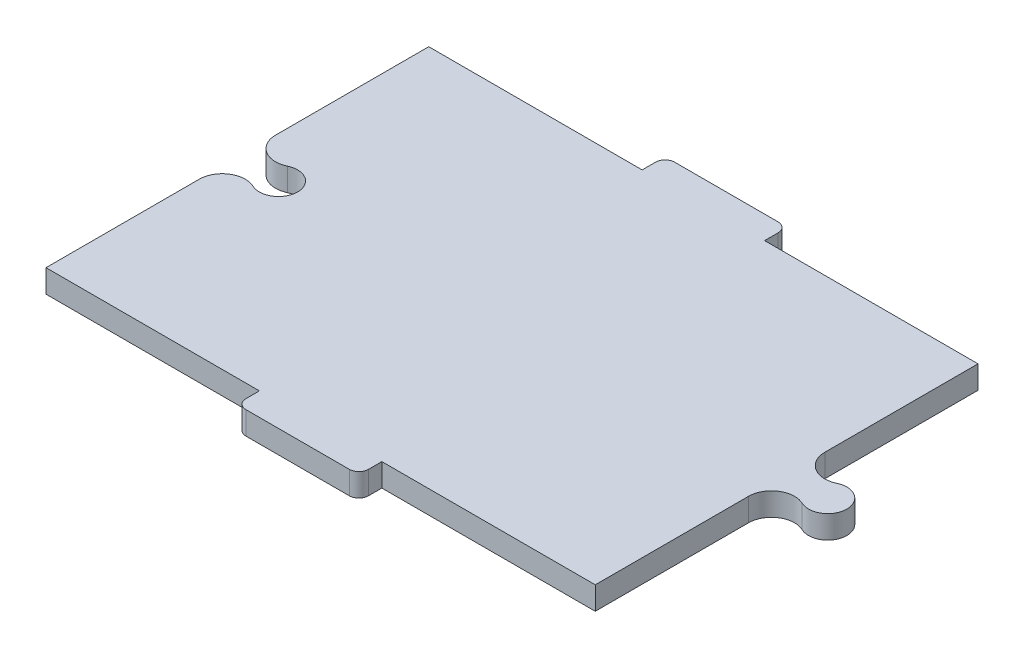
ISO-10303-21;
HEADER;
FILE_DESCRIPTION(('STEP AP214'),'2;1');
FILE_NAME('part.step','',(''),(''),'','','');
FILE_SCHEMA(('AUTOMOTIVE_DESIGN { 1 0 10303 214 1 1 1 1 }'));
ENDSEC;
DATA;
#1=APPLICATION_CONTEXT('core data for automotive mechanical design processes');
#2=APPLICATION_PROTOCOL_DEFINITION('international standard','automotive_design',2000,#1);
#3=PRODUCT_CONTEXT('',#1,'mechanical');
#4=PRODUCT('Part','Part','',(#3));
#5=PRODUCT_RELATED_PRODUCT_CATEGORY('part','',(#4));
#6=PRODUCT_DEFINITION_FORMATION('','',#4);
#7=PRODUCT_DEFINITION_CONTEXT('part definition',#1,'design');
#8=PRODUCT_DEFINITION('design','',#6,#7);
#9=PRODUCT_DEFINITION_SHAPE('','',#8);
#10=(LENGTH_UNIT() NAMED_UNIT(*) SI_UNIT(.MILLI.,.METRE.));
#11=(NAMED_UNIT(*) PLANE_ANGLE_UNIT() SI_UNIT($,.RADIAN.));
#12=(NAMED_UNIT(*) SI_UNIT($,.STERADIAN.) SOLID_ANGLE_UNIT());
#13=UNCERTAINTY_MEASURE_WITH_UNIT(LENGTH_MEASURE(1.E-05),#10,'distance_accuracy_value','');
#14=(GEOMETRIC_REPRESENTATION_CONTEXT(3) GLOBAL_UNCERTAINTY_ASSIGNED_CONTEXT((#13)) GLOBAL_UNIT_ASSIGNED_CONTEXT((#10,
#11,#12)) REPRESENTATION_CONTEXT('',''));
#15=CARTESIAN_POINT('',(0.,0.,0.));
#16=DIRECTION('',(0.,0.,1.));
#17=DIRECTION('',(1.,0.,0.));
#18=AXIS2_PLACEMENT_3D('',#15,#16,#17);
#19=CARTESIAN_POINT('',(143.505,12.,-19.9333928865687));
#20=DIRECTION('',(-1.,0.,0.));
#21=DIRECTION('',(0.,0.,1.));
#22=AXIS2_PLACEMENT_3D('',#19,#20,#21);
#23=PLANE('',#22);
#24=DIRECTION('',(0.,0.,-1.));
#25=VECTOR('',#24,1.);
#26=CARTESIAN_POINT('',(143.505,0.,-19.9333928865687));
#27=LINE('',#26,#25);
#28=CARTESIAN_POINT('',(143.505,0.,-19.9333928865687));
#29=VERTEX_POINT('',#28);
#30=CARTESIAN_POINT('',(143.505,0.,-100.));
#31=VERTEX_POINT('',#30);
#32=EDGE_CURVE('E224',#29,#31,#27,.T.);
#33=ORIENTED_EDGE('',*,*,#32,.T.);
#34=DIRECTION('',(0.,-1.,0.));
#35=VECTOR('',#34,1.);
#36=CARTESIAN_POINT('',(143.505,12.,-100.));
#37=LINE('',#36,#35);
#38=CARTESIAN_POINT('',(143.505,12.,-100.));
#39=VERTEX_POINT('',#38);
#40=EDGE_CURVE('E11',#39,#31,#37,.T.);
#41=ORIENTED_EDGE('',*,*,#40,.F.);
#42=DIRECTION('',(0.,0.,-1.));
#43=VECTOR('',#42,1.);
#44=CARTESIAN_POINT('',(143.505,12.,-19.9333928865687));
#45=LINE('',#44,#43);
#46=CARTESIAN_POINT('',(143.505,12.,-19.9333928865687));
#47=VERTEX_POINT('',#46);
#48=EDGE_CURVE('E270',#47,#39,#45,.T.);
#49=ORIENTED_EDGE('',*,*,#48,.F.);
#50=DIRECTION('',(0.,-1.,0.));
#51=VECTOR('',#50,1.);
#52=CARTESIAN_POINT('',(143.505,12.,-19.9333928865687));
#53=LINE('',#52,#51);
#54=EDGE_CURVE('E220',#47,#29,#53,.T.);
#55=ORIENTED_EDGE('',*,*,#54,.T.);
#56=EDGE_LOOP('',(#33,#41,#49,#55));
#57=FACE_BOUND('',#56,.T.);
#58=ADVANCED_FACE('F32',(#57),#23,.F.);
#59=CARTESIAN_POINT('',(32.,12.,-100.));
#60=DIRECTION('',(0.,0.,1.));
#61=DIRECTION('',(1.,0.,0.));
#62=AXIS2_PLACEMENT_3D('',#59,#60,#61);
#63=PLANE('',#62);
#64=DIRECTION('',(-1.,0.,0.));
#65=VECTOR('',#64,1.);
#66=CARTESIAN_POINT('',(32.,0.,-100.));
#67=LINE('',#66,#65);
#68=CARTESIAN_POINT('',(32.,0.,-100.));
#69=VERTEX_POINT('',#68);
#70=EDGE_CURVE('E227',#31,#69,#67,.T.);
#71=ORIENTED_EDGE('',*,*,#70,.T.);
#72=DIRECTION('',(0.,-1.,0.));
#73=VECTOR('',#72,1.);
#74=CARTESIAN_POINT('',(32.,12.,-100.));
#75=LINE('',#74,#73);
#76=CARTESIAN_POINT('',(32.,12.,-100.));
#77=VERTEX_POINT('',#76);
#78=EDGE_CURVE('E40',#77,#69,#75,.T.);
#79=ORIENTED_EDGE('',*,*,#78,.F.);
#80=DIRECTION('',(-1.,0.,0.));
#81=VECTOR('',#80,1.);
#82=CARTESIAN_POINT('',(32.,12.,-100.));
#83=LINE('',#82,#81);
#84=EDGE_CURVE('E139',#39,#77,#83,.T.);
#85=ORIENTED_EDGE('',*,*,#84,.F.);
#86=ORIENTED_EDGE('',*,*,#40,.T.);
#87=EDGE_LOOP('',(#71,#79,#85,#86));
#88=FACE_BOUND('',#87,.T.);
#89=ADVANCED_FACE('F408',(#88),#63,.F.);
#90=CARTESIAN_POINT('',(32.,12.,-107.));
#91=DIRECTION('',(-1.,0.,0.));
#92=DIRECTION('',(0.,0.,1.));
#93=AXIS2_PLACEMENT_3D('',#90,#91,#92);
#94=PLANE('',#93);
#95=DIRECTION('',(0.,0.,-1.));
#96=VECTOR('',#95,1.);
#97=CARTESIAN_POINT('',(32.,0.,-107.));
#98=LINE('',#97,#96);
#99=CARTESIAN_POINT('',(32.,0.,-107.));
#100=VERTEX_POINT('',#99);
#101=EDGE_CURVE('E229',#69,#100,#98,.T.);
#102=ORIENTED_EDGE('',*,*,#101,.T.);
#103=DIRECTION('',(0.,-1.,0.));
#104=VECTOR('',#103,1.);
#105=CARTESIAN_POINT('',(32.,12.,-107.));
#106=LINE('',#105,#104);
#107=CARTESIAN_POINT('',(32.,12.,-107.));
#108=VERTEX_POINT('',#107);
#109=EDGE_CURVE('E325',#108,#100,#106,.T.);
#110=ORIENTED_EDGE('',*,*,#109,.F.);
#111=DIRECTION('',(0.,0.,-1.));
#112=VECTOR('',#111,1.);
#113=CARTESIAN_POINT('',(32.,12.,-107.));
#114=LINE('',#113,#112);
#115=EDGE_CURVE('E333',#77,#108,#114,.T.);
#116=ORIENTED_EDGE('',*,*,#115,.F.);
#117=ORIENTED_EDGE('',*,*,#78,.T.);
#118=EDGE_LOOP('',(#102,#110,#116,#117));
#119=FACE_BOUND('',#118,.T.);
#120=ADVANCED_FACE('F331',(#119),#94,.F.);
#121=CARTESIAN_POINT('',(27.,12.,-107.));
#122=DIRECTION('',(0.,-1.,0.));
#123=DIRECTION('',(0.,0.,-1.));
#124=AXIS2_PLACEMENT_3D('',#121,#122,#123);
#125=CYLINDRICAL_SURFACE('',#124,5.00000000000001);
#126=CARTESIAN_POINT('',(27.,0.,-107.));
#127=DIRECTION('',(0.,1.,0.));
#128=DIRECTION('',(0.,0.,-1.));
#129=AXIS2_PLACEMENT_3D('',#126,#127,#128);
#130=CIRCLE('',#129,5.00000000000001);
#131=CARTESIAN_POINT('',(27.,0.,-112.));
#132=VERTEX_POINT('',#131);
#133=EDGE_CURVE('E231',#100,#132,#130,.T.);
#134=ORIENTED_EDGE('',*,*,#133,.T.);
#135=DIRECTION('',(0.,-1.,0.));
#136=VECTOR('',#135,1.);
#137=CARTESIAN_POINT('',(27.,12.,-112.));
#138=LINE('',#137,#136);
#139=CARTESIAN_POINT('',(27.,12.,-112.));
#140=VERTEX_POINT('',#139);
#141=EDGE_CURVE('E322',#140,#132,#138,.T.);
#142=ORIENTED_EDGE('',*,*,#141,.F.);
#143=CARTESIAN_POINT('',(27.,12.,-107.));
#144=DIRECTION('',(0.,1.,0.));
#145=DIRECTION('',(0.,0.,-1.));
#146=AXIS2_PLACEMENT_3D('',#143,#144,#145);
#147=CIRCLE('',#146,5.00000000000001);
#148=EDGE_CURVE('E351',#108,#140,#147,.T.);
#149=ORIENTED_EDGE('',*,*,#148,.F.);
#150=ORIENTED_EDGE('',*,*,#109,.T.);
#151=EDGE_LOOP('',(#134,#142,#149,#150));
#152=FACE_BOUND('',#151,.T.);
#153=ADVANCED_FACE('F342',(#152),#125,.T.);
#154=CARTESIAN_POINT('',(-27.,12.,-112.));
#155=DIRECTION('',(0.,0.,1.));
#156=DIRECTION('',(1.,0.,0.));
#157=AXIS2_PLACEMENT_3D('',#154,#155,#156);
#158=PLANE('',#157);
#159=DIRECTION('',(-1.,0.,0.));
#160=VECTOR('',#159,1.);
#161=CARTESIAN_POINT('',(-27.,0.,-112.));
#162=LINE('',#161,#160);
#163=CARTESIAN_POINT('',(-27.,0.,-112.));
#164=VERTEX_POINT('',#163);
#165=EDGE_CURVE('E233',#132,#164,#162,.T.);
#166=ORIENTED_EDGE('',*,*,#165,.T.);
#167=DIRECTION('',(0.,-1.,0.));
#168=VECTOR('',#167,1.);
#169=CARTESIAN_POINT('',(-27.,12.,-112.));
#170=LINE('',#169,#168);
#171=CARTESIAN_POINT('',(-27.,12.,-112.));
#172=VERTEX_POINT('',#171);
#173=EDGE_CURVE('E319',#172,#164,#170,.T.);
#174=ORIENTED_EDGE('',*,*,#173,.F.);
#175=DIRECTION('',(-1.,0.,0.));
#176=VECTOR('',#175,1.);
#177=CARTESIAN_POINT('',(-27.,12.,-112.));
#178=LINE('',#177,#176);
#179=EDGE_CURVE('E348',#140,#172,#178,.T.);
#180=ORIENTED_EDGE('',*,*,#179,.F.);
#181=ORIENTED_EDGE('',*,*,#141,.T.);
#182=EDGE_LOOP('',(#166,#174,#180,#181));
#183=FACE_BOUND('',#182,.T.);
#184=ADVANCED_FACE('F346',(#183),#158,.F.);
#185=CARTESIAN_POINT('',(-27.,12.,-107.));
#186=DIRECTION('',(0.,-1.,0.));
#187=DIRECTION('',(0.,0.,-1.));
#188=AXIS2_PLACEMENT_3D('',#185,#186,#187);
#189=CYLINDRICAL_SURFACE('',#188,5.);
#190=CARTESIAN_POINT('',(-27.,0.,-107.));
#191=DIRECTION('',(0.,1.,0.));
#192=DIRECTION('',(0.,0.,-1.));
#193=AXIS2_PLACEMENT_3D('',#190,#191,#192);
#194=CIRCLE('',#193,5.);
#195=CARTESIAN_POINT('',(-32.,0.,-107.));
#196=VERTEX_POINT('',#195);
#197=EDGE_CURVE('E235',#164,#196,#194,.T.);
#198=ORIENTED_EDGE('',*,*,#197,.T.);
#199=DIRECTION('',(0.,-1.,0.));
#200=VECTOR('',#199,1.);
#201=CARTESIAN_POINT('',(-32.,12.,-107.));
#202=LINE('',#201,#200);
#203=CARTESIAN_POINT('',(-32.,12.,-107.));
#204=VERTEX_POINT('',#203);
#205=EDGE_CURVE('E316',#204,#196,#202,.T.);
#206=ORIENTED_EDGE('',*,*,#205,.F.);
#207=CARTESIAN_POINT('',(-27.,12.,-107.));
#208=DIRECTION('',(0.,1.,0.));
#209=DIRECTION('',(0.,0.,-1.));
#210=AXIS2_PLACEMENT_3D('',#207,#208,#209);
#211=CIRCLE('',#210,5.);
#212=EDGE_CURVE('E350',#172,#204,#211,.T.);
#213=ORIENTED_EDGE('',*,*,#212,.F.);
#214=ORIENTED_EDGE('',*,*,#173,.T.);
#215=EDGE_LOOP('',(#198,#206,#213,#214));
#216=FACE_BOUND('',#215,.T.);
#217=ADVANCED_FACE('F421',(#216),#189,.T.);
#218=CARTESIAN_POINT('',(-32.,12.,-100.));
#219=DIRECTION('',(1.,0.,0.));
#220=DIRECTION('',(0.,0.,-1.));
#221=AXIS2_PLACEMENT_3D('',#218,#219,#220);
#222=PLANE('',#221);
#223=DIRECTION('',(0.,0.,1.));
#224=VECTOR('',#223,1.);
#225=CARTESIAN_POINT('',(-32.,0.,-100.));
#226=LINE('',#225,#224);
#227=CARTESIAN_POINT('',(-32.,0.,-100.));
#228=VERTEX_POINT('',#227);
#229=EDGE_CURVE('E237',#196,#228,#226,.T.);
#230=ORIENTED_EDGE('',*,*,#229,.T.);
#231=DIRECTION('',(0.,-1.,0.));
#232=VECTOR('',#231,1.);
#233=CARTESIAN_POINT('',(-32.,12.,-100.));
#234=LINE('',#233,#232);
#235=CARTESIAN_POINT('',(-32.,12.,-100.));
#236=VERTEX_POINT('',#235);
#237=EDGE_CURVE('E313',#236,#228,#234,.T.);
#238=ORIENTED_EDGE('',*,*,#237,.F.);
#239=DIRECTION('',(0.,0.,1.));
#240=VECTOR('',#239,1.);
#241=CARTESIAN_POINT('',(-32.,12.,-100.));
#242=LINE('',#241,#240);
#243=EDGE_CURVE('E353',#204,#236,#242,.T.);
#244=ORIENTED_EDGE('',*,*,#243,.F.);
#245=ORIENTED_EDGE('',*,*,#205,.T.);
#246=EDGE_LOOP('',(#230,#238,#244,#245));
#247=FACE_BOUND('',#246,.T.);
#248=ADVANCED_FACE('F424',(#247),#222,.F.);
#249=CARTESIAN_POINT('',(-143.505,12.,-100.));
#250=DIRECTION('',(0.,0.,1.));
#251=DIRECTION('',(1.,0.,0.));
#252=AXIS2_PLACEMENT_3D('',#249,#250,#251);
#253=PLANE('',#252);
#254=DIRECTION('',(-1.,0.,0.));
#255=VECTOR('',#254,1.);
#256=CARTESIAN_POINT('',(-143.505,0.,-100.));
#257=LINE('',#256,#255);
#258=CARTESIAN_POINT('',(-143.505,0.,-100.));
#259=VERTEX_POINT('',#258);
#260=EDGE_CURVE('E239',#228,#259,#257,.T.);
#261=ORIENTED_EDGE('',*,*,#260,.T.);
#262=DIRECTION('',(0.,-1.,0.));
#263=VECTOR('',#262,1.);
#264=CARTESIAN_POINT('',(-143.505,12.,-100.));
#265=LINE('',#264,#263);
#266=CARTESIAN_POINT('',(-143.505,12.,-100.));
#267=VERTEX_POINT('',#266);
#268=EDGE_CURVE('E310',#267,#259,#265,.T.);
#269=ORIENTED_EDGE('',*,*,#268,.F.);
#270=DIRECTION('',(-1.,0.,0.));
#271=VECTOR('',#270,1.);
#272=CARTESIAN_POINT('',(-143.505,12.,-100.));
#273=LINE('',#272,#271);
#274=EDGE_CURVE('E359',#236,#267,#273,.T.);
#275=ORIENTED_EDGE('',*,*,#274,.F.);
#276=ORIENTED_EDGE('',*,*,#237,.T.);
#277=EDGE_LOOP('',(#261,#269,#275,#276));
#278=FACE_BOUND('',#277,.T.);
#279=ADVANCED_FACE('F428',(#278),#253,.F.);
#280=CARTESIAN_POINT('',(-143.505,12.,-19.935));
#281=DIRECTION('',(1.,0.,0.));
#282=DIRECTION('',(0.,0.,-1.));
#283=AXIS2_PLACEMENT_3D('',#280,#281,#282);
#284=PLANE('',#283);
#285=DIRECTION('',(0.,0.,1.));
#286=VECTOR('',#285,1.);
#287=CARTESIAN_POINT('',(-143.505,0.,-19.935));
#288=LINE('',#287,#286);
#289=CARTESIAN_POINT('',(-143.505,0.,-19.935));
#290=VERTEX_POINT('',#289);
#291=EDGE_CURVE('E241',#259,#290,#288,.T.);
#292=ORIENTED_EDGE('',*,*,#291,.T.);
#293=DIRECTION('',(0.,-1.,0.));
#294=VECTOR('',#293,1.);
#295=CARTESIAN_POINT('',(-143.505,12.,-19.935));
#296=LINE('',#295,#294);
#297=CARTESIAN_POINT('',(-143.505,12.,-19.935));
#298=VERTEX_POINT('',#297);
#299=EDGE_CURVE('E307',#298,#290,#296,.T.);
#300=ORIENTED_EDGE('',*,*,#299,.F.);
#301=DIRECTION('',(0.,0.,1.));
#302=VECTOR('',#301,1.);
#303=CARTESIAN_POINT('',(-143.505,12.,-19.935));
#304=LINE('',#303,#302);
#305=EDGE_CURVE('E361',#267,#298,#304,.T.);
#306=ORIENTED_EDGE('',*,*,#305,.F.);
#307=ORIENTED_EDGE('',*,*,#268,.T.);
#308=EDGE_LOOP('',(#292,#300,#306,#307));
#309=FACE_BOUND('',#308,.T.);
#310=ADVANCED_FACE('F432',(#309),#284,.F.);
#311=CARTESIAN_POINT('',(-131.455,12.,-19.935));
#312=DIRECTION('',(0.,-1.,0.));
#313=DIRECTION('',(0.,0.,-1.));
#314=AXIS2_PLACEMENT_3D('',#311,#312,#313);
#315=CYLINDRICAL_SURFACE('',#314,12.05);
#316=CARTESIAN_POINT('',(-131.455,0.,-19.935));
#317=DIRECTION('',(0.,1.,0.));
#318=DIRECTION('',(0.,0.,1.));
#319=AXIS2_PLACEMENT_3D('',#316,#317,#318);
#320=CIRCLE('',#319,12.05);
#321=CARTESIAN_POINT('',(-126.305314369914,0.,-9.04081632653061));
#322=VERTEX_POINT('',#321);
#323=EDGE_CURVE('E243',#290,#322,#320,.T.);
#324=ORIENTED_EDGE('',*,*,#323,.T.);
#325=DIRECTION('',(0.,-1.,0.));
#326=VECTOR('',#325,1.);
#327=CARTESIAN_POINT('',(-126.305314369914,12.,-9.04081632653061));
#328=LINE('',#327,#326);
#329=CARTESIAN_POINT('',(-126.305314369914,12.,-9.04081632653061));
#330=VERTEX_POINT('',#329);
#331=EDGE_CURVE('E304',#330,#322,#328,.T.);
#332=ORIENTED_EDGE('',*,*,#331,.F.);
#333=CARTESIAN_POINT('',(-131.455,12.,-19.935));
#334=DIRECTION('',(0.,1.,0.));
#335=DIRECTION('',(0.,0.,1.));
#336=AXIS2_PLACEMENT_3D('',#333,#334,#335);
#337=CIRCLE('',#336,12.05);
#338=EDGE_CURVE('E363',#298,#330,#337,.T.);
#339=ORIENTED_EDGE('',*,*,#338,.F.);
#340=ORIENTED_EDGE('',*,*,#299,.T.);
#341=EDGE_LOOP('',(#324,#332,#339,#340));
#342=FACE_BOUND('',#341,.T.);
#343=ADVANCED_FACE('F436',(#342),#315,.T.);
#344=CARTESIAN_POINT('',(-122.031716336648,12.,0.));
#345=DIRECTION('',(0.,-1.,0.));
#346=DIRECTION('',(0.,0.,-1.));
#347=AXIS2_PLACEMENT_3D('',#344,#345,#346);
#348=CYLINDRICAL_SURFACE('',#347,10.);
#349=CARTESIAN_POINT('',(-122.031716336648,0.,0.));
#350=DIRECTION('',(0.,-1.,0.));
#351=DIRECTION('',(0.,0.,-1.));
#352=AXIS2_PLACEMENT_3D('',#349,#350,#351);
#353=CIRCLE('',#352,10.);
#354=CARTESIAN_POINT('',(-126.305314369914,0.,9.04081632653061));
#355=VERTEX_POINT('',#354);
#356=EDGE_CURVE('E245',#322,#355,#353,.T.);
#357=ORIENTED_EDGE('',*,*,#356,.T.);
#358=DIRECTION('',(0.,-1.,0.));
#359=VECTOR('',#358,1.);
#360=CARTESIAN_POINT('',(-126.305314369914,12.,9.04081632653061));
#361=LINE('',#360,#359);
#362=CARTESIAN_POINT('',(-126.305314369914,12.,9.04081632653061));
#363=VERTEX_POINT('',#362);
#364=EDGE_CURVE('E301',#363,#355,#361,.T.);
#365=ORIENTED_EDGE('',*,*,#364,.F.);
#366=CARTESIAN_POINT('',(-122.031716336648,12.,0.));
#367=DIRECTION('',(0.,-1.,0.));
#368=DIRECTION('',(0.,0.,-1.));
#369=AXIS2_PLACEMENT_3D('',#366,#367,#368);
#370=CIRCLE('',#369,10.);
#371=EDGE_CURVE('E365',#330,#363,#370,.T.);
#372=ORIENTED_EDGE('',*,*,#371,.F.);
#373=ORIENTED_EDGE('',*,*,#331,.T.);
#374=EDGE_LOOP('',(#357,#365,#372,#373));
#375=FACE_BOUND('',#374,.T.);
#376=ADVANCED_FACE('F440',(#375),#348,.F.);
#377=CARTESIAN_POINT('',(-131.455,12.,19.935));
#378=DIRECTION('',(0.,-1.,0.));
#379=DIRECTION('',(0.,0.,-1.));
#380=AXIS2_PLACEMENT_3D('',#377,#378,#379);
#381=CYLINDRICAL_SURFACE('',#380,12.05);
#382=CARTESIAN_POINT('',(-131.455,0.,19.935));
#383=DIRECTION('',(0.,1.,0.));
#384=DIRECTION('',(0.,0.,-1.));
#385=AXIS2_PLACEMENT_3D('',#382,#383,#384);
#386=CIRCLE('',#385,12.05);
#387=CARTESIAN_POINT('',(-143.505,0.,19.935));
#388=VERTEX_POINT('',#387);
#389=EDGE_CURVE('E247',#355,#388,#386,.T.);
#390=ORIENTED_EDGE('',*,*,#389,.T.);
#391=DIRECTION('',(0.,-1.,0.));
#392=VECTOR('',#391,1.);
#393=CARTESIAN_POINT('',(-143.505,12.,19.935));
#394=LINE('',#393,#392);
#395=CARTESIAN_POINT('',(-143.505,12.,19.935));
#396=VERTEX_POINT('',#395);
#397=EDGE_CURVE('E298',#396,#388,#394,.T.);
#398=ORIENTED_EDGE('',*,*,#397,.F.);
#399=CARTESIAN_POINT('',(-131.455,12.,19.935));
#400=DIRECTION('',(0.,1.,0.));
#401=DIRECTION('',(0.,0.,-1.));
#402=AXIS2_PLACEMENT_3D('',#399,#400,#401);
#403=CIRCLE('',#402,12.05);
#404=EDGE_CURVE('E367',#363,#396,#403,.T.);
#405=ORIENTED_EDGE('',*,*,#404,.F.);
#406=ORIENTED_EDGE('',*,*,#364,.T.);
#407=EDGE_LOOP('',(#390,#398,#405,#406));
#408=FACE_BOUND('',#407,.T.);
#409=ADVANCED_FACE('F444',(#408),#381,.T.);
#410=CARTESIAN_POINT('',(-143.505,12.,100.));
#411=DIRECTION('',(1.,0.,0.));
#412=DIRECTION('',(0.,0.,-1.));
#413=AXIS2_PLACEMENT_3D('',#410,#411,#412);
#414=PLANE('',#413);
#415=DIRECTION('',(0.,0.,1.));
#416=VECTOR('',#415,1.);
#417=CARTESIAN_POINT('',(-143.505,0.,100.));
#418=LINE('',#417,#416);
#419=CARTESIAN_POINT('',(-143.505,0.,100.));
#420=VERTEX_POINT('',#419);
#421=EDGE_CURVE('E249',#388,#420,#418,.T.);
#422=ORIENTED_EDGE('',*,*,#421,.T.);
#423=DIRECTION('',(0.,-1.,0.));
#424=VECTOR('',#423,1.);
#425=CARTESIAN_POINT('',(-143.505,12.,100.));
#426=LINE('',#425,#424);
#427=CARTESIAN_POINT('',(-143.505,12.,100.));
#428=VERTEX_POINT('',#427);
#429=EDGE_CURVE('E295',#428,#420,#426,.T.);
#430=ORIENTED_EDGE('',*,*,#429,.F.);
#431=DIRECTION('',(0.,0.,1.));
#432=VECTOR('',#431,1.);
#433=CARTESIAN_POINT('',(-143.505,12.,100.));
#434=LINE('',#433,#432);
#435=EDGE_CURVE('E369',#396,#428,#434,.T.);
#436=ORIENTED_EDGE('',*,*,#435,.F.);
#437=ORIENTED_EDGE('',*,*,#397,.T.);
#438=EDGE_LOOP('',(#422,#430,#436,#437));
#439=FACE_BOUND('',#438,.T.);
#440=ADVANCED_FACE('F448',(#439),#414,.F.);
#441=CARTESIAN_POINT('',(-143.505,12.,100.));
#442=DIRECTION('',(0.,0.,-1.));
#443=DIRECTION('',(-1.,0.,0.));
#444=AXIS2_PLACEMENT_3D('',#441,#442,#443);
#445=PLANE('',#444);
#446=DIRECTION('',(1.,0.,0.));
#447=VECTOR('',#446,1.);
#448=CARTESIAN_POINT('',(-143.505,0.,100.));
#449=LINE('',#448,#447);
#450=CARTESIAN_POINT('',(-32.,0.,100.));
#451=VERTEX_POINT('',#450);
#452=EDGE_CURVE('E251',#420,#451,#449,.T.);
#453=ORIENTED_EDGE('',*,*,#452,.T.);
#454=DIRECTION('',(0.,-1.,0.));
#455=VECTOR('',#454,1.);
#456=CARTESIAN_POINT('',(-32.,12.,100.));
#457=LINE('',#456,#455);
#458=CARTESIAN_POINT('',(-32.,12.,100.));
#459=VERTEX_POINT('',#458);
#460=EDGE_CURVE('E292',#459,#451,#457,.T.);
#461=ORIENTED_EDGE('',*,*,#460,.F.);
#462=DIRECTION('',(1.,0.,0.));
#463=VECTOR('',#462,1.);
#464=CARTESIAN_POINT('',(-143.505,12.,100.));
#465=LINE('',#464,#463);
#466=EDGE_CURVE('E371',#428,#459,#465,.T.);
#467=ORIENTED_EDGE('',*,*,#466,.F.);
#468=ORIENTED_EDGE('',*,*,#429,.T.);
#469=EDGE_LOOP('',(#453,#461,#467,#468));
#470=FACE_BOUND('',#469,.T.);
#471=ADVANCED_FACE('F452',(#470),#445,.F.);
#472=CARTESIAN_POINT('',(-32.,12.,100.));
#473=DIRECTION('',(1.,0.,0.));
#474=DIRECTION('',(0.,0.,-1.));
#475=AXIS2_PLACEMENT_3D('',#472,#473,#474);
#476=PLANE('',#475);
#477=DIRECTION('',(0.,0.,1.));
#478=VECTOR('',#477,1.);
#479=CARTESIAN_POINT('',(-32.,0.,100.));
#480=LINE('',#479,#478);
#481=CARTESIAN_POINT('',(-32.0000000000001,0.,107.));
#482=VERTEX_POINT('',#481);
#483=EDGE_CURVE('E253',#451,#482,#480,.T.);
#484=ORIENTED_EDGE('',*,*,#483,.T.);
#485=DIRECTION('',(0.,-1.,0.));
#486=VECTOR('',#485,1.);
#487=CARTESIAN_POINT('',(-32.0000000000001,12.,107.));
#488=LINE('',#487,#486);
#489=CARTESIAN_POINT('',(-32.0000000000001,12.,107.));
#490=VERTEX_POINT('',#489);
#491=EDGE_CURVE('E289',#490,#482,#488,.T.);
#492=ORIENTED_EDGE('',*,*,#491,.F.);
#493=DIRECTION('',(0.,0.,1.));
#494=VECTOR('',#493,1.);
#495=CARTESIAN_POINT('',(-32.,12.,100.));
#496=LINE('',#495,#494);
#497=EDGE_CURVE('E373',#459,#490,#496,.T.);
#498=ORIENTED_EDGE('',*,*,#497,.F.);
#499=ORIENTED_EDGE('',*,*,#460,.T.);
#500=EDGE_LOOP('',(#484,#492,#498,#499));
#501=FACE_BOUND('',#500,.T.);
#502=ADVANCED_FACE('F456',(#501),#476,.F.);
#503=CARTESIAN_POINT('',(-27.0000000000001,12.,107.));
#504=DIRECTION('',(0.,-1.,0.));
#505=DIRECTION('',(0.,0.,-1.));
#506=AXIS2_PLACEMENT_3D('',#503,#504,#505);
#507=CYLINDRICAL_SURFACE('',#506,5.);
#508=CARTESIAN_POINT('',(-27.0000000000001,0.,107.));
#509=DIRECTION('',(0.,1.,0.));
#510=DIRECTION('',(0.,0.,1.));
#511=AXIS2_PLACEMENT_3D('',#508,#509,#510);
#512=CIRCLE('',#511,5.);
#513=CARTESIAN_POINT('',(-27.0000000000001,0.,112.));
#514=VERTEX_POINT('',#513);
#515=EDGE_CURVE('E255',#482,#514,#512,.T.);
#516=ORIENTED_EDGE('',*,*,#515,.T.);
#517=DIRECTION('',(0.,-1.,0.));
#518=VECTOR('',#517,1.);
#519=CARTESIAN_POINT('',(-27.0000000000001,12.,112.));
#520=LINE('',#519,#518);
#521=CARTESIAN_POINT('',(-27.0000000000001,12.,112.));
#522=VERTEX_POINT('',#521);
#523=EDGE_CURVE('E286',#522,#514,#520,.T.);
#524=ORIENTED_EDGE('',*,*,#523,.F.);
#525=CARTESIAN_POINT('',(-27.0000000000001,12.,107.));
#526=DIRECTION('',(0.,1.,0.));
#527=DIRECTION('',(0.,0.,1.));
#528=AXIS2_PLACEMENT_3D('',#525,#526,#527);
#529=CIRCLE('',#528,5.);
#530=EDGE_CURVE('E375',#490,#522,#529,.T.);
#531=ORIENTED_EDGE('',*,*,#530,.F.);
#532=ORIENTED_EDGE('',*,*,#491,.T.);
#533=EDGE_LOOP('',(#516,#524,#531,#532));
#534=FACE_BOUND('',#533,.T.);
#535=ADVANCED_FACE('F460',(#534),#507,.T.);
#536=CARTESIAN_POINT('',(-27.0000000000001,12.,112.));
#537=DIRECTION('',(0.,0.,-1.));
#538=DIRECTION('',(-1.,0.,0.));
#539=AXIS2_PLACEMENT_3D('',#536,#537,#538);
#540=PLANE('',#539);
#541=DIRECTION('',(1.,0.,0.));
#542=VECTOR('',#541,1.);
#543=CARTESIAN_POINT('',(-27.0000000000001,0.,112.));
#544=LINE('',#543,#542);
#545=CARTESIAN_POINT('',(26.9999999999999,0.,112.));
#546=VERTEX_POINT('',#545);
#547=EDGE_CURVE('E257',#514,#546,#544,.T.);
#548=ORIENTED_EDGE('',*,*,#547,.T.);
#549=DIRECTION('',(0.,-1.,0.));
#550=VECTOR('',#549,1.);
#551=CARTESIAN_POINT('',(26.9999999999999,12.,112.));
#552=LINE('',#551,#550);
#553=CARTESIAN_POINT('',(26.9999999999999,12.,112.));
#554=VERTEX_POINT('',#553);
#555=EDGE_CURVE('E283',#554,#546,#552,.T.);
#556=ORIENTED_EDGE('',*,*,#555,.F.);
#557=DIRECTION('',(1.,0.,0.));
#558=VECTOR('',#557,1.);
#559=CARTESIAN_POINT('',(-27.0000000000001,12.,112.));
#560=LINE('',#559,#558);
#561=EDGE_CURVE('E377',#522,#554,#560,.T.);
#562=ORIENTED_EDGE('',*,*,#561,.F.);
#563=ORIENTED_EDGE('',*,*,#523,.T.);
#564=EDGE_LOOP('',(#548,#556,#562,#563));
#565=FACE_BOUND('',#564,.T.);
#566=ADVANCED_FACE('F464',(#565),#540,.F.);
#567=CARTESIAN_POINT('',(26.9999999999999,12.,107.));
#568=DIRECTION('',(0.,-1.,0.));
#569=DIRECTION('',(0.,0.,-1.));
#570=AXIS2_PLACEMENT_3D('',#567,#568,#569);
#571=CYLINDRICAL_SURFACE('',#570,5.00000000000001);
#572=CARTESIAN_POINT('',(26.9999999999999,0.,107.));
#573=DIRECTION('',(0.,1.,0.));
#574=DIRECTION('',(0.,0.,1.));
#575=AXIS2_PLACEMENT_3D('',#572,#573,#574);
#576=CIRCLE('',#575,5.00000000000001);
#577=CARTESIAN_POINT('',(31.9999999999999,0.,107.));
#578=VERTEX_POINT('',#577);
#579=EDGE_CURVE('E259',#546,#578,#576,.T.);
#580=ORIENTED_EDGE('',*,*,#579,.T.);
#581=DIRECTION('',(0.,-1.,0.));
#582=VECTOR('',#581,1.);
#583=CARTESIAN_POINT('',(31.9999999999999,12.,107.));
#584=LINE('',#583,#582);
#585=CARTESIAN_POINT('',(31.9999999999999,12.,107.));
#586=VERTEX_POINT('',#585);
#587=EDGE_CURVE('E280',#586,#578,#584,.T.);
#588=ORIENTED_EDGE('',*,*,#587,.F.);
#589=CARTESIAN_POINT('',(26.9999999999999,12.,107.));
#590=DIRECTION('',(0.,1.,0.));
#591=DIRECTION('',(0.,0.,1.));
#592=AXIS2_PLACEMENT_3D('',#589,#590,#591);
#593=CIRCLE('',#592,5.00000000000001);
#594=EDGE_CURVE('E379',#554,#586,#593,.T.);
#595=ORIENTED_EDGE('',*,*,#594,.F.);
#596=ORIENTED_EDGE('',*,*,#555,.T.);
#597=EDGE_LOOP('',(#580,#588,#595,#596));
#598=FACE_BOUND('',#597,.T.);
#599=ADVANCED_FACE('F468',(#598),#571,.T.);
#600=CARTESIAN_POINT('',(31.9999999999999,12.,107.));
#601=DIRECTION('',(-1.,0.,0.));
#602=DIRECTION('',(0.,0.,1.));
#603=AXIS2_PLACEMENT_3D('',#600,#601,#602);
#604=PLANE('',#603);
#605=DIRECTION('',(0.,0.,-1.));
#606=VECTOR('',#605,1.);
#607=CARTESIAN_POINT('',(31.9999999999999,0.,107.));
#608=LINE('',#607,#606);
#609=CARTESIAN_POINT('',(32.,0.,100.));
#610=VERTEX_POINT('',#609);
#611=EDGE_CURVE('E261',#578,#610,#608,.T.);
#612=ORIENTED_EDGE('',*,*,#611,.T.);
#613=DIRECTION('',(0.,-1.,0.));
#614=VECTOR('',#613,1.);
#615=CARTESIAN_POINT('',(32.,12.,100.));
#616=LINE('',#615,#614);
#617=CARTESIAN_POINT('',(32.,12.,100.));
#618=VERTEX_POINT('',#617);
#619=EDGE_CURVE('E277',#618,#610,#616,.T.);
#620=ORIENTED_EDGE('',*,*,#619,.F.);
#621=DIRECTION('',(0.,0.,-1.));
#622=VECTOR('',#621,1.);
#623=CARTESIAN_POINT('',(31.9999999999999,12.,107.));
#624=LINE('',#623,#622);
#625=EDGE_CURVE('E381',#586,#618,#624,.T.);
#626=ORIENTED_EDGE('',*,*,#625,.F.);
#627=ORIENTED_EDGE('',*,*,#587,.T.);
#628=EDGE_LOOP('',(#612,#620,#626,#627));
#629=FACE_BOUND('',#628,.T.);
#630=ADVANCED_FACE('F472',(#629),#604,.F.);
#631=CARTESIAN_POINT('',(32.,12.,100.));
#632=DIRECTION('',(0.,0.,-1.));
#633=DIRECTION('',(-1.,0.,0.));
#634=AXIS2_PLACEMENT_3D('',#631,#632,#633);
#635=PLANE('',#634);
#636=DIRECTION('',(1.,0.,0.));
#637=VECTOR('',#636,1.);
#638=CARTESIAN_POINT('',(32.,0.,100.));
#639=LINE('',#638,#637);
#640=CARTESIAN_POINT('',(143.505,0.,100.));
#641=VERTEX_POINT('',#640);
#642=EDGE_CURVE('E263',#610,#641,#639,.T.);
#643=ORIENTED_EDGE('',*,*,#642,.T.);
#644=DIRECTION('',(0.,-1.,0.));
#645=VECTOR('',#644,1.);
#646=CARTESIAN_POINT('',(143.505,12.,100.));
#647=LINE('',#646,#645);
#648=CARTESIAN_POINT('',(143.505,12.,100.));
#649=VERTEX_POINT('',#648);
#650=EDGE_CURVE('E274',#649,#641,#647,.T.);
#651=ORIENTED_EDGE('',*,*,#650,.F.);
#652=DIRECTION('',(1.,0.,0.));
#653=VECTOR('',#652,1.);
#654=CARTESIAN_POINT('',(32.,12.,100.));
#655=LINE('',#654,#653);
#656=EDGE_CURVE('E383',#618,#649,#655,.T.);
#657=ORIENTED_EDGE('',*,*,#656,.F.);
#658=ORIENTED_EDGE('',*,*,#619,.T.);
#659=EDGE_LOOP('',(#643,#651,#657,#658));
#660=FACE_BOUND('',#659,.T.);
#661=ADVANCED_FACE('F389',(#660),#635,.F.);
#662=CARTESIAN_POINT('',(143.505,12.,100.));
#663=DIRECTION('',(-1.,0.,0.));
#664=DIRECTION('',(0.,0.,1.));
#665=AXIS2_PLACEMENT_3D('',#662,#663,#664);
#666=PLANE('',#665);
#667=DIRECTION('',(0.,0.,-1.));
#668=VECTOR('',#667,1.);
#669=CARTESIAN_POINT('',(143.505,0.,100.));
#670=LINE('',#669,#668);
#671=CARTESIAN_POINT('',(143.505,0.,19.9333928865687));
#672=VERTEX_POINT('',#671);
#673=EDGE_CURVE('E265',#641,#672,#670,.T.);
#674=ORIENTED_EDGE('',*,*,#673,.T.);
#675=DIRECTION('',(0.,-1.,0.));
#676=VECTOR('',#675,1.);
#677=CARTESIAN_POINT('',(143.505,12.,19.9333928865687));
#678=LINE('',#677,#676);
#679=CARTESIAN_POINT('',(143.505,12.,19.9333928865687));
#680=VERTEX_POINT('',#679);
#681=EDGE_CURVE('E215',#680,#672,#678,.T.);
#682=ORIENTED_EDGE('',*,*,#681,.F.);
#683=DIRECTION('',(0.,0.,-1.));
#684=VECTOR('',#683,1.);
#685=CARTESIAN_POINT('',(143.505,12.,100.));
#686=LINE('',#685,#684);
#687=EDGE_CURVE('E206',#649,#680,#686,.T.);
#688=ORIENTED_EDGE('',*,*,#687,.F.);
#689=ORIENTED_EDGE('',*,*,#650,.T.);
#690=EDGE_LOOP('',(#674,#682,#688,#689));
#691=FACE_BOUND('',#690,.T.);
#692=ADVANCED_FACE('F393',(#691),#666,.F.);
#693=CARTESIAN_POINT('',(155.555532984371,12.,19.9333928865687));
#694=DIRECTION('',(0.,-1.,0.));
#695=DIRECTION('',(0.,0.,-1.));
#696=AXIS2_PLACEMENT_3D('',#693,#694,#695);
#697=CYLINDRICAL_SURFACE('',#696,12.0505329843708);
#698=CARTESIAN_POINT('',(155.555532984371,0.,19.9333928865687));
#699=DIRECTION('',(0.,-1.,0.));
#700=DIRECTION('',(0.,0.,-1.));
#701=AXIS2_PLACEMENT_3D('',#698,#699,#700);
#702=CIRCLE('',#701,12.0505329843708);
#703=CARTESIAN_POINT('',(160.707860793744,0.,9.03986896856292));
#704=VERTEX_POINT('',#703);
#705=EDGE_CURVE('E214',#672,#704,#702,.T.);
#706=ORIENTED_EDGE('',*,*,#705,.T.);
#707=DIRECTION('',(0.,-1.,0.));
#708=VECTOR('',#707,1.);
#709=CARTESIAN_POINT('',(160.707860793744,12.,9.03986896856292));
#710=LINE('',#709,#708);
#711=CARTESIAN_POINT('',(160.707860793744,12.,9.03986896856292));
#712=VERTEX_POINT('',#711);
#713=EDGE_CURVE('E211',#712,#704,#710,.T.);
#714=ORIENTED_EDGE('',*,*,#713,.F.);
#715=CARTESIAN_POINT('',(155.555532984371,12.,19.9333928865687));
#716=DIRECTION('',(0.,-1.,0.));
#717=DIRECTION('',(0.,0.,-1.));
#718=AXIS2_PLACEMENT_3D('',#715,#716,#717);
#719=CIRCLE('',#718,12.0505329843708);
#720=EDGE_CURVE('E200',#680,#712,#719,.T.);
#721=ORIENTED_EDGE('',*,*,#720,.F.);
#722=ORIENTED_EDGE('',*,*,#681,.T.);
#723=EDGE_LOOP('',(#706,#714,#721,#722));
#724=FACE_BOUND('',#723,.T.);
#725=ADVANCED_FACE('F212',(#724),#697,.F.);
#726=CARTESIAN_POINT('',(164.983462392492,12.,0.));
#727=DIRECTION('',(0.,-1.,0.));
#728=DIRECTION('',(0.,0.,-1.));
#729=AXIS2_PLACEMENT_3D('',#726,#727,#728);
#730=CYLINDRICAL_SURFACE('',#729,10.);
#731=CARTESIAN_POINT('',(164.983462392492,0.,0.));
#732=DIRECTION('',(0.,1.,0.));
#733=DIRECTION('',(0.,0.,-1.));
#734=AXIS2_PLACEMENT_3D('',#731,#732,#733);
#735=CIRCLE('',#734,10.);
#736=CARTESIAN_POINT('',(160.707860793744,0.,-9.03986896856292));
#737=VERTEX_POINT('',#736);
#738=EDGE_CURVE('E125',#704,#737,#735,.T.);
#739=ORIENTED_EDGE('',*,*,#738,.T.);
#740=DIRECTION('',(0.,-1.,0.));
#741=VECTOR('',#740,1.);
#742=CARTESIAN_POINT('',(160.707860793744,12.,-9.03986896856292));
#743=LINE('',#742,#741);
#744=CARTESIAN_POINT('',(160.707860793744,12.,-9.03986896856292));
#745=VERTEX_POINT('',#744);
#746=EDGE_CURVE('E216',#745,#737,#743,.T.);
#747=ORIENTED_EDGE('',*,*,#746,.F.);
#748=CARTESIAN_POINT('',(164.983462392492,12.,0.));
#749=DIRECTION('',(0.,1.,0.));
#750=DIRECTION('',(0.,0.,-1.));
#751=AXIS2_PLACEMENT_3D('',#748,#749,#750);
#752=CIRCLE('',#751,10.);
#753=EDGE_CURVE('E204',#712,#745,#752,.T.);
#754=ORIENTED_EDGE('',*,*,#753,.F.);
#755=ORIENTED_EDGE('',*,*,#713,.T.);
#756=EDGE_LOOP('',(#739,#747,#754,#755));
#757=FACE_BOUND('',#756,.T.);
#758=ADVANCED_FACE('F218',(#757),#730,.T.);
#759=CARTESIAN_POINT('',(155.555532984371,12.,-19.9333928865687));
#760=DIRECTION('',(0.,-1.,0.));
#761=DIRECTION('',(0.,0.,-1.));
#762=AXIS2_PLACEMENT_3D('',#759,#760,#761);
#763=CYLINDRICAL_SURFACE('',#762,12.0505329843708);
#764=CARTESIAN_POINT('',(155.555532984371,0.,-19.9333928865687));
#765=DIRECTION('',(0.,-1.,0.));
#766=DIRECTION('',(0.,0.,1.));
#767=AXIS2_PLACEMENT_3D('',#764,#765,#766);
#768=CIRCLE('',#767,12.0505329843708);
#769=EDGE_CURVE('E131',#737,#29,#768,.T.);
#770=ORIENTED_EDGE('',*,*,#769,.T.);
#771=ORIENTED_EDGE('',*,*,#54,.F.);
#772=CARTESIAN_POINT('',(155.555532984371,12.,-19.9333928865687));
#773=DIRECTION('',(0.,-1.,0.));
#774=DIRECTION('',(0.,0.,1.));
#775=AXIS2_PLACEMENT_3D('',#772,#773,#774);
#776=CIRCLE('',#775,12.0505329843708);
#777=EDGE_CURVE('E48',#745,#47,#776,.T.);
#778=ORIENTED_EDGE('',*,*,#777,.F.);
#779=ORIENTED_EDGE('',*,*,#746,.T.);
#780=EDGE_LOOP('',(#770,#771,#778,#779));
#781=FACE_BOUND('',#780,.T.);
#782=ADVANCED_FACE('F397',(#781),#763,.F.);
#783=CARTESIAN_POINT('',(27.,12.,-107.));
#784=DIRECTION('',(0.,-1.,0.));
#785=DIRECTION('',(0.,0.,-1.));
#786=AXIS2_PLACEMENT_3D('',#783,#784,#785);
#787=PLANE('',#786);
#788=ORIENTED_EDGE('',*,*,#48,.T.);
#789=ORIENTED_EDGE('',*,*,#84,.T.);
#790=ORIENTED_EDGE('',*,*,#115,.T.);
#791=ORIENTED_EDGE('',*,*,#148,.T.);
#792=ORIENTED_EDGE('',*,*,#179,.T.);
#793=ORIENTED_EDGE('',*,*,#212,.T.);
#794=ORIENTED_EDGE('',*,*,#243,.T.);
#795=ORIENTED_EDGE('',*,*,#274,.T.);
#796=ORIENTED_EDGE('',*,*,#305,.T.);
#797=ORIENTED_EDGE('',*,*,#338,.T.);
#798=ORIENTED_EDGE('',*,*,#371,.T.);
#799=ORIENTED_EDGE('',*,*,#404,.T.);
#800=ORIENTED_EDGE('',*,*,#435,.T.);
#801=ORIENTED_EDGE('',*,*,#466,.T.);
#802=ORIENTED_EDGE('',*,*,#497,.T.);
#803=ORIENTED_EDGE('',*,*,#530,.T.);
#804=ORIENTED_EDGE('',*,*,#561,.T.);
#805=ORIENTED_EDGE('',*,*,#594,.T.);
#806=ORIENTED_EDGE('',*,*,#625,.T.);
#807=ORIENTED_EDGE('',*,*,#656,.T.);
#808=ORIENTED_EDGE('',*,*,#687,.T.);
#809=ORIENTED_EDGE('',*,*,#720,.T.);
#810=ORIENTED_EDGE('',*,*,#753,.T.);
#811=ORIENTED_EDGE('',*,*,#777,.T.);
#812=EDGE_LOOP('',(#788,#789,#790,#791,#792,#793,#794,#795,#796,#797,#798,#799,#800,#801,#802,
#803,#804,#805,#806,#807,#808,#809,#810,#811));
#813=FACE_BOUND('',#812,.T.);
#814=ADVANCED_FACE('F202',(#813),#787,.F.);
#815=CARTESIAN_POINT('',(27.,0.,-107.));
#816=DIRECTION('',(0.,-1.,0.));
#817=DIRECTION('',(0.,0.,-1.));
#818=AXIS2_PLACEMENT_3D('',#815,#816,#817);
#819=PLANE('',#818);
#820=ORIENTED_EDGE('',*,*,#32,.F.);
#821=ORIENTED_EDGE('',*,*,#769,.F.);
#822=ORIENTED_EDGE('',*,*,#738,.F.);
#823=ORIENTED_EDGE('',*,*,#705,.F.);
#824=ORIENTED_EDGE('',*,*,#673,.F.);
#825=ORIENTED_EDGE('',*,*,#642,.F.);
#826=ORIENTED_EDGE('',*,*,#611,.F.);
#827=ORIENTED_EDGE('',*,*,#579,.F.);
#828=ORIENTED_EDGE('',*,*,#547,.F.);
#829=ORIENTED_EDGE('',*,*,#515,.F.);
#830=ORIENTED_EDGE('',*,*,#483,.F.);
#831=ORIENTED_EDGE('',*,*,#452,.F.);
#832=ORIENTED_EDGE('',*,*,#421,.F.);
#833=ORIENTED_EDGE('',*,*,#389,.F.);
#834=ORIENTED_EDGE('',*,*,#356,.F.);
#835=ORIENTED_EDGE('',*,*,#323,.F.);
#836=ORIENTED_EDGE('',*,*,#291,.F.);
#837=ORIENTED_EDGE('',*,*,#260,.F.);
#838=ORIENTED_EDGE('',*,*,#229,.F.);
#839=ORIENTED_EDGE('',*,*,#197,.F.);
#840=ORIENTED_EDGE('',*,*,#165,.F.);
#841=ORIENTED_EDGE('',*,*,#133,.F.);
#842=ORIENTED_EDGE('',*,*,#101,.F.);
#843=ORIENTED_EDGE('',*,*,#70,.F.);
#844=EDGE_LOOP('',(#820,#821,#822,#823,#824,#825,#826,#827,#828,#829,#830,#831,#832,#833,#834,
#835,#836,#837,#838,#839,#840,#841,#842,#843));
#845=FACE_BOUND('',#844,.T.);
#846=ADVANCED_FACE('F337',(#845),#819,.T.);
#847=CLOSED_SHELL('',(#58,#89,#120,#153,#184,#217,#248,#279,#310,#343,#376,#409,#440,#471,#502,
#535,#566,#599,#630,#661,#692,#725,#758,#782,#814,#846));
#848=MANIFOLD_SOLID_BREP('B2',#847);
#849=ADVANCED_BREP_SHAPE_REPRESENTATION('',(#18,#848),#14);
#850=SHAPE_DEFINITION_REPRESENTATION(#9,#849);
ENDSEC;
END-ISO-10303-21;
